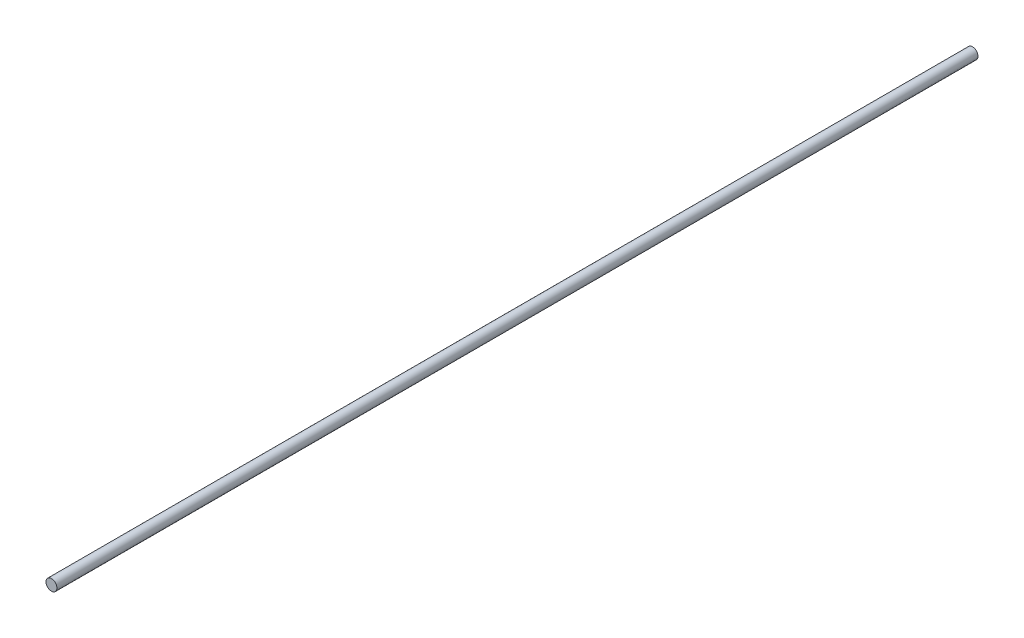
ISO-10303-21;
HEADER;
FILE_DESCRIPTION(('STEP AP214'),'2;1');
FILE_NAME('part.step','',(''),(''),'','','');
FILE_SCHEMA(('AUTOMOTIVE_DESIGN { 1 0 10303 214 1 1 1 1 }'));
ENDSEC;
DATA;
#1=APPLICATION_CONTEXT('core data for automotive mechanical design processes');
#2=APPLICATION_PROTOCOL_DEFINITION('international standard','automotive_design',2000,#1);
#3=PRODUCT_CONTEXT('',#1,'mechanical');
#4=PRODUCT('Part','Part','',(#3));
#5=PRODUCT_RELATED_PRODUCT_CATEGORY('part','',(#4));
#6=PRODUCT_DEFINITION_FORMATION('','',#4);
#7=PRODUCT_DEFINITION_CONTEXT('part definition',#1,'design');
#8=PRODUCT_DEFINITION('design','',#6,#7);
#9=PRODUCT_DEFINITION_SHAPE('','',#8);
#10=(LENGTH_UNIT() NAMED_UNIT(*) SI_UNIT(.MILLI.,.METRE.));
#11=(NAMED_UNIT(*) PLANE_ANGLE_UNIT() SI_UNIT($,.RADIAN.));
#12=(NAMED_UNIT(*) SI_UNIT($,.STERADIAN.) SOLID_ANGLE_UNIT());
#13=UNCERTAINTY_MEASURE_WITH_UNIT(LENGTH_MEASURE(1.E-05),#10,'distance_accuracy_value','');
#14=(GEOMETRIC_REPRESENTATION_CONTEXT(3) GLOBAL_UNCERTAINTY_ASSIGNED_CONTEXT((#13)) GLOBAL_UNIT_ASSIGNED_CONTEXT((#10,
#11,#12)) REPRESENTATION_CONTEXT('',''));
#15=CARTESIAN_POINT('',(0.,0.,0.));
#16=DIRECTION('',(0.,0.,1.));
#17=DIRECTION('',(1.,0.,0.));
#18=AXIS2_PLACEMENT_3D('',#15,#16,#17);
#19=CARTESIAN_POINT('',(0.,0.,-5050.));
#20=DIRECTION('',(0.,0.,1.));
#21=DIRECTION('',(1.,0.,0.));
#22=AXIS2_PLACEMENT_3D('',#19,#20,#21);
#23=CYLINDRICAL_SURFACE('',#22,30.);
#24=CARTESIAN_POINT('',(0.,0.,-5050.));
#25=DIRECTION('',(0.,0.,1.));
#26=DIRECTION('',(1.,0.,0.));
#27=AXIS2_PLACEMENT_3D('',#24,#25,#26);
#28=CIRCLE('',#27,30.);
#29=CARTESIAN_POINT('',(30.,0.,-5050.));
#30=VERTEX_POINT('',#29);
#31=EDGE_CURVE('E10',#30,#30,#28,.T.);
#32=ORIENTED_EDGE('',*,*,#31,.T.);
#33=EDGE_LOOP('',(#32));
#34=FACE_BOUND('',#33,.T.);
#35=CARTESIAN_POINT('',(0.,0.,0.));
#36=DIRECTION('',(0.,0.,1.));
#37=DIRECTION('',(1.,0.,0.));
#38=AXIS2_PLACEMENT_3D('',#35,#36,#37);
#39=CIRCLE('',#38,30.);
#40=CARTESIAN_POINT('',(30.,0.,0.));
#41=VERTEX_POINT('',#40);
#42=EDGE_CURVE('E40',#41,#41,#39,.T.);
#43=ORIENTED_EDGE('',*,*,#42,.F.);
#44=EDGE_LOOP('',(#43));
#45=FACE_BOUND('',#44,.T.);
#46=ADVANCED_FACE('F37',(#34,#45),#23,.T.);
#47=CARTESIAN_POINT('',(0.,0.,-5050.));
#48=DIRECTION('',(0.,0.,1.));
#49=DIRECTION('',(1.,0.,0.));
#50=AXIS2_PLACEMENT_3D('',#47,#48,#49);
#51=PLANE('',#50);
#52=ORIENTED_EDGE('',*,*,#31,.F.);
#53=EDGE_LOOP('',(#52));
#54=FACE_BOUND('',#53,.T.);
#55=ADVANCED_FACE('F54',(#54),#51,.F.);
#56=CARTESIAN_POINT('',(0.,0.,0.));
#57=DIRECTION('',(0.,0.,1.));
#58=DIRECTION('',(1.,0.,0.));
#59=AXIS2_PLACEMENT_3D('',#56,#57,#58);
#60=PLANE('',#59);
#61=ORIENTED_EDGE('',*,*,#42,.T.);
#62=EDGE_LOOP('',(#61));
#63=FACE_BOUND('',#62,.T.);
#64=ADVANCED_FACE('F51',(#63),#60,.T.);
#65=CLOSED_SHELL('',(#46,#55,#64));
#66=MANIFOLD_SOLID_BREP('B2',#65);
#67=ADVANCED_BREP_SHAPE_REPRESENTATION('',(#18,#66),#14);
#68=SHAPE_DEFINITION_REPRESENTATION(#9,#67);
ENDSEC;
END-ISO-10303-21;
